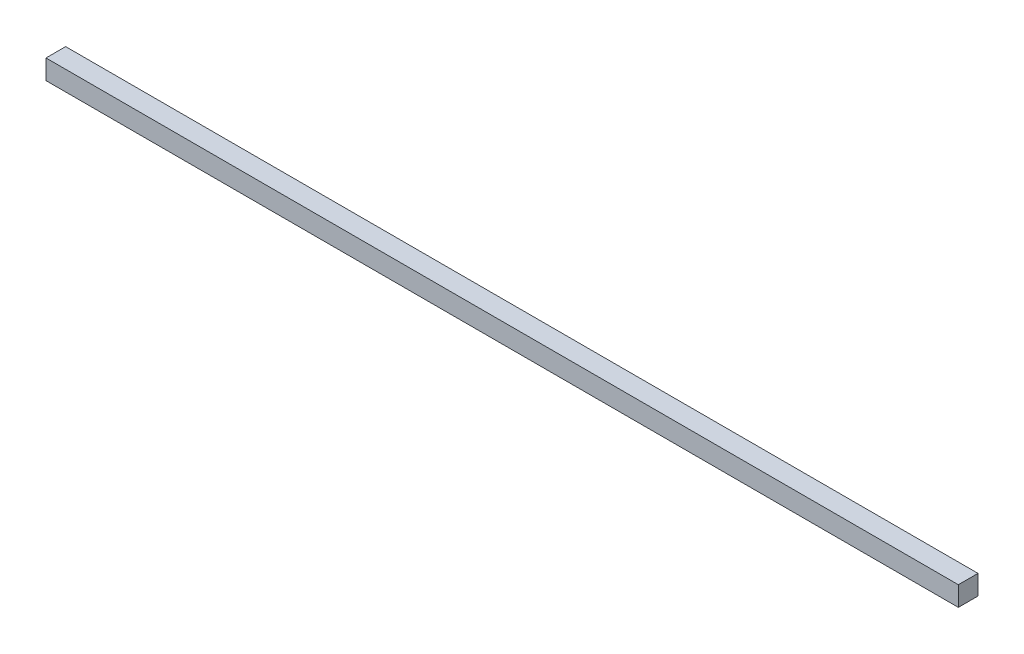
ISO-10303-21;
HEADER;
FILE_DESCRIPTION(('STEP AP214'),'2;1');
FILE_NAME('part.step','',(''),(''),'','','');
FILE_SCHEMA(('AUTOMOTIVE_DESIGN { 1 0 10303 214 1 1 1 1 }'));
ENDSEC;
DATA;
#1=APPLICATION_CONTEXT('core data for automotive mechanical design processes');
#2=APPLICATION_PROTOCOL_DEFINITION('international standard','automotive_design',2000,#1);
#3=PRODUCT_CONTEXT('',#1,'mechanical');
#4=PRODUCT('Part','Part','',(#3));
#5=PRODUCT_RELATED_PRODUCT_CATEGORY('part','',(#4));
#6=PRODUCT_DEFINITION_FORMATION('','',#4);
#7=PRODUCT_DEFINITION_CONTEXT('part definition',#1,'design');
#8=PRODUCT_DEFINITION('design','',#6,#7);
#9=PRODUCT_DEFINITION_SHAPE('','',#8);
#10=(LENGTH_UNIT() NAMED_UNIT(*) SI_UNIT(.MILLI.,.METRE.));
#11=(NAMED_UNIT(*) PLANE_ANGLE_UNIT() SI_UNIT($,.RADIAN.));
#12=(NAMED_UNIT(*) SI_UNIT($,.STERADIAN.) SOLID_ANGLE_UNIT());
#13=UNCERTAINTY_MEASURE_WITH_UNIT(LENGTH_MEASURE(1.E-05),#10,'distance_accuracy_value','');
#14=(GEOMETRIC_REPRESENTATION_CONTEXT(3) GLOBAL_UNCERTAINTY_ASSIGNED_CONTEXT((#13)) GLOBAL_UNIT_ASSIGNED_CONTEXT((#10,
#11,#12)) REPRESENTATION_CONTEXT('',''));
#15=CARTESIAN_POINT('',(0.,0.,0.));
#16=DIRECTION('',(0.,0.,1.));
#17=DIRECTION('',(1.,0.,0.));
#18=AXIS2_PLACEMENT_3D('',#15,#16,#17);
#19=CARTESIAN_POINT('',(650.,12.25,39.875));
#20=DIRECTION('',(0.,0.,-1.));
#21=DIRECTION('',(-1.,0.,0.));
#22=AXIS2_PLACEMENT_3D('',#19,#20,#21);
#23=PLANE('',#22);
#24=DIRECTION('',(0.,-1.,0.));
#25=VECTOR('',#24,1.);
#26=CARTESIAN_POINT('',(0.,12.25,39.875));
#27=LINE('',#26,#25);
#28=CARTESIAN_POINT('',(0.,12.25,39.875));
#29=VERTEX_POINT('',#28);
#30=CARTESIAN_POINT('',(0.,-1.75000000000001,39.875));
#31=VERTEX_POINT('',#30);
#32=EDGE_CURVE('E97',#29,#31,#27,.T.);
#33=ORIENTED_EDGE('',*,*,#32,.T.);
#34=DIRECTION('',(-1.,0.,0.));
#35=VECTOR('',#34,1.);
#36=CARTESIAN_POINT('',(650.,-1.75000000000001,39.875));
#37=LINE('',#36,#35);
#38=CARTESIAN_POINT('',(650.,-1.75000000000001,39.875));
#39=VERTEX_POINT('',#38);
#40=EDGE_CURVE('E11',#39,#31,#37,.T.);
#41=ORIENTED_EDGE('',*,*,#40,.F.);
#42=DIRECTION('',(0.,-1.,0.));
#43=VECTOR('',#42,1.);
#44=CARTESIAN_POINT('',(650.,12.25,39.875));
#45=LINE('',#44,#43);
#46=CARTESIAN_POINT('',(650.,12.25,39.875));
#47=VERTEX_POINT('',#46);
#48=EDGE_CURVE('E85',#47,#39,#45,.T.);
#49=ORIENTED_EDGE('',*,*,#48,.F.);
#50=DIRECTION('',(-1.,0.,0.));
#51=VECTOR('',#50,1.);
#52=CARTESIAN_POINT('',(650.,12.25,39.875));
#53=LINE('',#52,#51);
#54=EDGE_CURVE('E93',#47,#29,#53,.T.);
#55=ORIENTED_EDGE('',*,*,#54,.T.);
#56=EDGE_LOOP('',(#33,#41,#49,#55));
#57=FACE_BOUND('',#56,.T.);
#58=ADVANCED_FACE('F34',(#57),#23,.F.);
#59=CARTESIAN_POINT('',(650.,-1.75000000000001,39.875));
#60=DIRECTION('',(0.,1.,0.));
#61=DIRECTION('',(0.,0.,1.));
#62=AXIS2_PLACEMENT_3D('',#59,#60,#61);
#63=PLANE('',#62);
#64=DIRECTION('',(0.,0.,-1.));
#65=VECTOR('',#64,1.);
#66=CARTESIAN_POINT('',(0.,-1.75000000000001,39.875));
#67=LINE('',#66,#65);
#68=CARTESIAN_POINT('',(0.,-1.75000000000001,25.875));
#69=VERTEX_POINT('',#68);
#70=EDGE_CURVE('E89',#31,#69,#67,.T.);
#71=ORIENTED_EDGE('',*,*,#70,.T.);
#72=DIRECTION('',(-1.,0.,0.));
#73=VECTOR('',#72,1.);
#74=CARTESIAN_POINT('',(650.,-1.75000000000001,25.875));
#75=LINE('',#74,#73);
#76=CARTESIAN_POINT('',(650.,-1.75000000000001,25.875));
#77=VERTEX_POINT('',#76);
#78=EDGE_CURVE('E42',#77,#69,#75,.T.);
#79=ORIENTED_EDGE('',*,*,#78,.F.);
#80=DIRECTION('',(0.,0.,-1.));
#81=VECTOR('',#80,1.);
#82=CARTESIAN_POINT('',(650.,-1.75000000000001,39.875));
#83=LINE('',#82,#81);
#84=EDGE_CURVE('E80',#39,#77,#83,.T.);
#85=ORIENTED_EDGE('',*,*,#84,.F.);
#86=ORIENTED_EDGE('',*,*,#40,.T.);
#87=EDGE_LOOP('',(#71,#79,#85,#86));
#88=FACE_BOUND('',#87,.T.);
#89=ADVANCED_FACE('F88',(#88),#63,.F.);
#90=CARTESIAN_POINT('',(650.,12.25,25.875));
#91=DIRECTION('',(0.,0.,1.));
#92=DIRECTION('',(1.,0.,0.));
#93=AXIS2_PLACEMENT_3D('',#90,#91,#92);
#94=PLANE('',#93);
#95=DIRECTION('',(0.,1.,0.));
#96=VECTOR('',#95,1.);
#97=CARTESIAN_POINT('',(0.,12.25,25.875));
#98=LINE('',#97,#96);
#99=CARTESIAN_POINT('',(0.,12.25,25.875));
#100=VERTEX_POINT('',#99);
#101=EDGE_CURVE('E67',#69,#100,#98,.T.);
#102=ORIENTED_EDGE('',*,*,#101,.T.);
#103=DIRECTION('',(-1.,0.,0.));
#104=VECTOR('',#103,1.);
#105=CARTESIAN_POINT('',(650.,12.25,25.875));
#106=LINE('',#105,#104);
#107=CARTESIAN_POINT('',(650.,12.25,25.875));
#108=VERTEX_POINT('',#107);
#109=EDGE_CURVE('E90',#108,#100,#106,.T.);
#110=ORIENTED_EDGE('',*,*,#109,.F.);
#111=DIRECTION('',(0.,1.,0.));
#112=VECTOR('',#111,1.);
#113=CARTESIAN_POINT('',(650.,12.25,25.875));
#114=LINE('',#113,#112);
#115=EDGE_CURVE('E83',#77,#108,#114,.T.);
#116=ORIENTED_EDGE('',*,*,#115,.F.);
#117=ORIENTED_EDGE('',*,*,#78,.T.);
#118=EDGE_LOOP('',(#102,#110,#116,#117));
#119=FACE_BOUND('',#118,.T.);
#120=ADVANCED_FACE('F91',(#119),#94,.F.);
#121=CARTESIAN_POINT('',(650.,12.25,39.875));
#122=DIRECTION('',(0.,-1.,0.));
#123=DIRECTION('',(0.,0.,-1.));
#124=AXIS2_PLACEMENT_3D('',#121,#122,#123);
#125=PLANE('',#124);
#126=DIRECTION('',(0.,0.,1.));
#127=VECTOR('',#126,1.);
#128=CARTESIAN_POINT('',(0.,12.25,39.875));
#129=LINE('',#128,#127);
#130=EDGE_CURVE('E73',#100,#29,#129,.T.);
#131=ORIENTED_EDGE('',*,*,#130,.T.);
#132=ORIENTED_EDGE('',*,*,#54,.F.);
#133=DIRECTION('',(0.,0.,1.));
#134=VECTOR('',#133,1.);
#135=CARTESIAN_POINT('',(650.,12.25,39.875));
#136=LINE('',#135,#134);
#137=EDGE_CURVE('E50',#108,#47,#136,.T.);
#138=ORIENTED_EDGE('',*,*,#137,.F.);
#139=ORIENTED_EDGE('',*,*,#109,.T.);
#140=EDGE_LOOP('',(#131,#132,#138,#139));
#141=FACE_BOUND('',#140,.T.);
#142=ADVANCED_FACE('F104',(#141),#125,.F.);
#143=CARTESIAN_POINT('',(650.,0.,0.));
#144=DIRECTION('',(1.,0.,0.));
#145=DIRECTION('',(0.,0.,-1.));
#146=AXIS2_PLACEMENT_3D('',#143,#144,#145);
#147=PLANE('',#146);
#148=ORIENTED_EDGE('',*,*,#48,.T.);
#149=ORIENTED_EDGE('',*,*,#84,.T.);
#150=ORIENTED_EDGE('',*,*,#115,.T.);
#151=ORIENTED_EDGE('',*,*,#137,.T.);
#152=EDGE_LOOP('',(#148,#149,#150,#151));
#153=FACE_BOUND('',#152,.T.);
#154=ADVANCED_FACE('F81',(#153),#147,.T.);
#155=CARTESIAN_POINT('',(0.,0.,0.));
#156=DIRECTION('',(1.,0.,0.));
#157=DIRECTION('',(0.,0.,-1.));
#158=AXIS2_PLACEMENT_3D('',#155,#156,#157);
#159=PLANE('',#158);
#160=ORIENTED_EDGE('',*,*,#32,.F.);
#161=ORIENTED_EDGE('',*,*,#130,.F.);
#162=ORIENTED_EDGE('',*,*,#101,.F.);
#163=ORIENTED_EDGE('',*,*,#70,.F.);
#164=EDGE_LOOP('',(#160,#161,#162,#163));
#165=FACE_BOUND('',#164,.T.);
#166=ADVANCED_FACE('F107',(#165),#159,.F.);
#167=CLOSED_SHELL('',(#58,#89,#120,#142,#154,#166));
#168=MANIFOLD_SOLID_BREP('B2',#167);
#169=ADVANCED_BREP_SHAPE_REPRESENTATION('',(#18,#168),#14);
#170=SHAPE_DEFINITION_REPRESENTATION(#9,#169);
ENDSEC;
END-ISO-10303-21;
